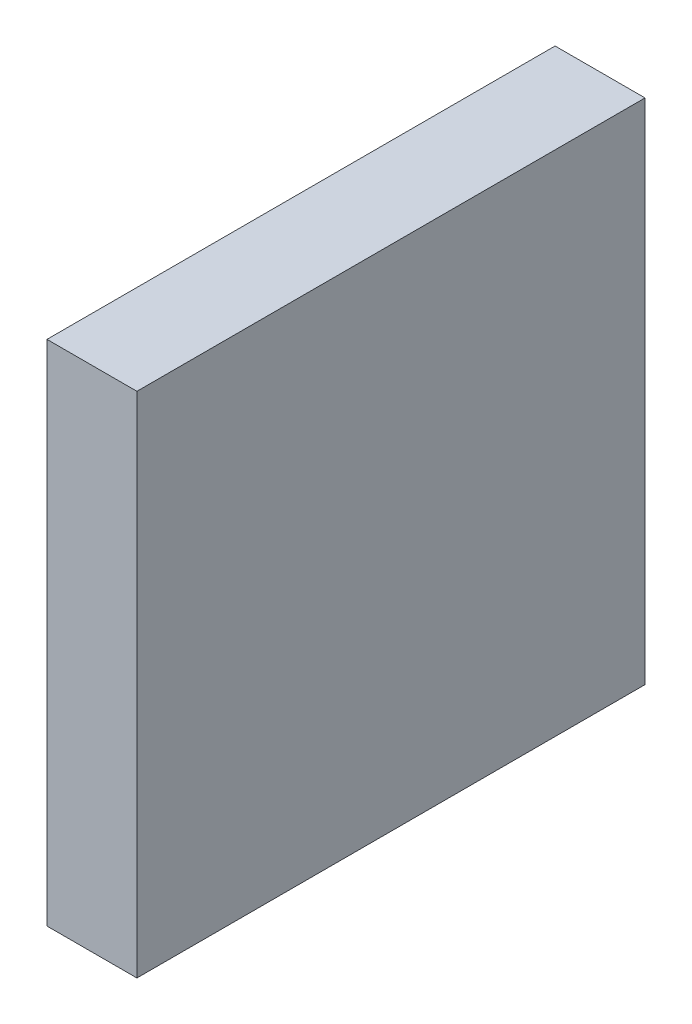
ISO-10303-21;
HEADER;
FILE_DESCRIPTION(('STEP AP214'),'2;1');
FILE_NAME('part.step','',(''),(''),'','','');
FILE_SCHEMA(('AUTOMOTIVE_DESIGN { 1 0 10303 214 1 1 1 1 }'));
ENDSEC;
DATA;
#1=APPLICATION_CONTEXT('core data for automotive mechanical design processes');
#2=APPLICATION_PROTOCOL_DEFINITION('international standard','automotive_design',2000,#1);
#3=PRODUCT_CONTEXT('',#1,'mechanical');
#4=PRODUCT('Part','Part','',(#3));
#5=PRODUCT_RELATED_PRODUCT_CATEGORY('part','',(#4));
#6=PRODUCT_DEFINITION_FORMATION('','',#4);
#7=PRODUCT_DEFINITION_CONTEXT('part definition',#1,'design');
#8=PRODUCT_DEFINITION('design','',#6,#7);
#9=PRODUCT_DEFINITION_SHAPE('','',#8);
#10=(LENGTH_UNIT() NAMED_UNIT(*) SI_UNIT(.MILLI.,.METRE.));
#11=(NAMED_UNIT(*) PLANE_ANGLE_UNIT() SI_UNIT($,.RADIAN.));
#12=(NAMED_UNIT(*) SI_UNIT($,.STERADIAN.) SOLID_ANGLE_UNIT());
#13=UNCERTAINTY_MEASURE_WITH_UNIT(LENGTH_MEASURE(1.E-05),#10,'distance_accuracy_value','');
#14=(GEOMETRIC_REPRESENTATION_CONTEXT(3) GLOBAL_UNCERTAINTY_ASSIGNED_CONTEXT((#13)) GLOBAL_UNIT_ASSIGNED_CONTEXT((#10,
#11,#12)) REPRESENTATION_CONTEXT('',''));
#15=CARTESIAN_POINT('',(0.,0.,0.));
#16=DIRECTION('',(0.,0.,1.));
#17=DIRECTION('',(1.,0.,0.));
#18=AXIS2_PLACEMENT_3D('',#15,#16,#17);
#19=CARTESIAN_POINT('',(4.4958,0.,0.));
#20=DIRECTION('',(0.,0.,-1.));
#21=DIRECTION('',(-1.,0.,0.));
#22=AXIS2_PLACEMENT_3D('',#19,#20,#21);
#23=PLANE('',#22);
#24=DIRECTION('',(0.,-1.,0.));
#25=VECTOR('',#24,1.);
#26=CARTESIAN_POINT('',(0.,0.,0.));
#27=LINE('',#26,#25);
#28=CARTESIAN_POINT('',(0.,25.4,0.));
#29=VERTEX_POINT('',#28);
#30=CARTESIAN_POINT('',(0.,0.,0.));
#31=VERTEX_POINT('',#30);
#32=EDGE_CURVE('E74',#29,#31,#27,.T.);
#33=ORIENTED_EDGE('',*,*,#32,.T.);
#34=DIRECTION('',(-1.,0.,0.));
#35=VECTOR('',#34,1.);
#36=CARTESIAN_POINT('',(4.4958,0.,0.));
#37=LINE('',#36,#35);
#38=CARTESIAN_POINT('',(4.4958,0.,0.));
#39=VERTEX_POINT('',#38);
#40=EDGE_CURVE('E11',#39,#31,#37,.T.);
#41=ORIENTED_EDGE('',*,*,#40,.F.);
#42=DIRECTION('',(0.,-1.,0.));
#43=VECTOR('',#42,1.);
#44=CARTESIAN_POINT('',(4.4958,0.,0.));
#45=LINE('',#44,#43);
#46=CARTESIAN_POINT('',(4.4958,25.4,0.));
#47=VERTEX_POINT('',#46);
#48=EDGE_CURVE('E92',#47,#39,#45,.T.);
#49=ORIENTED_EDGE('',*,*,#48,.F.);
#50=DIRECTION('',(-1.,0.,0.));
#51=VECTOR('',#50,1.);
#52=CARTESIAN_POINT('',(4.4958,25.4,0.));
#53=LINE('',#52,#51);
#54=EDGE_CURVE('E86',#47,#29,#53,.T.);
#55=ORIENTED_EDGE('',*,*,#54,.T.);
#56=EDGE_LOOP('',(#33,#41,#49,#55));
#57=FACE_BOUND('',#56,.T.);
#58=ADVANCED_FACE('F30',(#57),#23,.F.);
#59=CARTESIAN_POINT('',(4.4958,0.,0.));
#60=DIRECTION('',(0.,1.,0.));
#61=DIRECTION('',(0.,0.,1.));
#62=AXIS2_PLACEMENT_3D('',#59,#60,#61);
#63=PLANE('',#62);
#64=DIRECTION('',(0.,0.,-1.));
#65=VECTOR('',#64,1.);
#66=CARTESIAN_POINT('',(0.,0.,0.));
#67=LINE('',#66,#65);
#68=CARTESIAN_POINT('',(0.,0.,-25.4));
#69=VERTEX_POINT('',#68);
#70=EDGE_CURVE('E70',#31,#69,#67,.T.);
#71=ORIENTED_EDGE('',*,*,#70,.T.);
#72=DIRECTION('',(-1.,0.,0.));
#73=VECTOR('',#72,1.);
#74=CARTESIAN_POINT('',(4.4958,0.,-25.4));
#75=LINE('',#74,#73);
#76=CARTESIAN_POINT('',(4.4958,0.,-25.4));
#77=VERTEX_POINT('',#76);
#78=EDGE_CURVE('E37',#77,#69,#75,.T.);
#79=ORIENTED_EDGE('',*,*,#78,.F.);
#80=DIRECTION('',(0.,0.,-1.));
#81=VECTOR('',#80,1.);
#82=CARTESIAN_POINT('',(4.4958,0.,0.));
#83=LINE('',#82,#81);
#84=EDGE_CURVE('E82',#39,#77,#83,.T.);
#85=ORIENTED_EDGE('',*,*,#84,.F.);
#86=ORIENTED_EDGE('',*,*,#40,.T.);
#87=EDGE_LOOP('',(#71,#79,#85,#86));
#88=FACE_BOUND('',#87,.T.);
#89=ADVANCED_FACE('F81',(#88),#63,.F.);
#90=CARTESIAN_POINT('',(4.4958,0.,-25.4));
#91=DIRECTION('',(0.,0.,1.));
#92=DIRECTION('',(1.,0.,0.));
#93=AXIS2_PLACEMENT_3D('',#90,#91,#92);
#94=PLANE('',#93);
#95=DIRECTION('',(0.,1.,0.));
#96=VECTOR('',#95,1.);
#97=CARTESIAN_POINT('',(0.,0.,-25.4));
#98=LINE('',#97,#96);
#99=CARTESIAN_POINT('',(0.,25.4,-25.4));
#100=VERTEX_POINT('',#99);
#101=EDGE_CURVE('E75',#69,#100,#98,.T.);
#102=ORIENTED_EDGE('',*,*,#101,.T.);
#103=DIRECTION('',(-1.,0.,0.));
#104=VECTOR('',#103,1.);
#105=CARTESIAN_POINT('',(4.4958,25.4,-25.4));
#106=LINE('',#105,#104);
#107=CARTESIAN_POINT('',(4.4958,25.4,-25.4));
#108=VERTEX_POINT('',#107);
#109=EDGE_CURVE('E98',#108,#100,#106,.T.);
#110=ORIENTED_EDGE('',*,*,#109,.F.);
#111=DIRECTION('',(0.,1.,0.));
#112=VECTOR('',#111,1.);
#113=CARTESIAN_POINT('',(4.4958,0.,-25.4));
#114=LINE('',#113,#112);
#115=EDGE_CURVE('E49',#77,#108,#114,.T.);
#116=ORIENTED_EDGE('',*,*,#115,.F.);
#117=ORIENTED_EDGE('',*,*,#78,.T.);
#118=EDGE_LOOP('',(#102,#110,#116,#117));
#119=FACE_BOUND('',#118,.T.);
#120=ADVANCED_FACE('F101',(#119),#94,.F.);
#121=CARTESIAN_POINT('',(4.4958,25.4,0.));
#122=DIRECTION('',(0.,-1.,0.));
#123=DIRECTION('',(0.,0.,-1.));
#124=AXIS2_PLACEMENT_3D('',#121,#122,#123);
#125=PLANE('',#124);
#126=DIRECTION('',(0.,0.,1.));
#127=VECTOR('',#126,1.);
#128=CARTESIAN_POINT('',(0.,25.4,0.));
#129=LINE('',#128,#127);
#130=EDGE_CURVE('E90',#100,#29,#129,.T.);
#131=ORIENTED_EDGE('',*,*,#130,.T.);
#132=ORIENTED_EDGE('',*,*,#54,.F.);
#133=DIRECTION('',(0.,0.,1.));
#134=VECTOR('',#133,1.);
#135=CARTESIAN_POINT('',(4.4958,25.4,0.));
#136=LINE('',#135,#134);
#137=EDGE_CURVE('E44',#108,#47,#136,.T.);
#138=ORIENTED_EDGE('',*,*,#137,.F.);
#139=ORIENTED_EDGE('',*,*,#109,.T.);
#140=EDGE_LOOP('',(#131,#132,#138,#139));
#141=FACE_BOUND('',#140,.T.);
#142=ADVANCED_FACE('F103',(#141),#125,.F.);
#143=CARTESIAN_POINT('',(4.4958,25.4,0.));
#144=DIRECTION('',(-1.,0.,0.));
#145=DIRECTION('',(0.,0.,1.));
#146=AXIS2_PLACEMENT_3D('',#143,#144,#145);
#147=PLANE('',#146);
#148=ORIENTED_EDGE('',*,*,#48,.T.);
#149=ORIENTED_EDGE('',*,*,#84,.T.);
#150=ORIENTED_EDGE('',*,*,#115,.T.);
#151=ORIENTED_EDGE('',*,*,#137,.T.);
#152=EDGE_LOOP('',(#148,#149,#150,#151));
#153=FACE_BOUND('',#152,.T.);
#154=ADVANCED_FACE('F104',(#153),#147,.F.);
#155=CARTESIAN_POINT('',(0.,25.4,0.));
#156=DIRECTION('',(-1.,0.,0.));
#157=DIRECTION('',(0.,0.,1.));
#158=AXIS2_PLACEMENT_3D('',#155,#156,#157);
#159=PLANE('',#158);
#160=ORIENTED_EDGE('',*,*,#32,.F.);
#161=ORIENTED_EDGE('',*,*,#130,.F.);
#162=ORIENTED_EDGE('',*,*,#101,.F.);
#163=ORIENTED_EDGE('',*,*,#70,.F.);
#164=EDGE_LOOP('',(#160,#161,#162,#163));
#165=FACE_BOUND('',#164,.T.);
#166=ADVANCED_FACE('F71',(#165),#159,.T.);
#167=CLOSED_SHELL('',(#58,#89,#120,#142,#154,#166));
#168=MANIFOLD_SOLID_BREP('B2',#167);
#169=ADVANCED_BREP_SHAPE_REPRESENTATION('',(#18,#168),#14);
#170=SHAPE_DEFINITION_REPRESENTATION(#9,#169);
ENDSEC;
END-ISO-10303-21;
